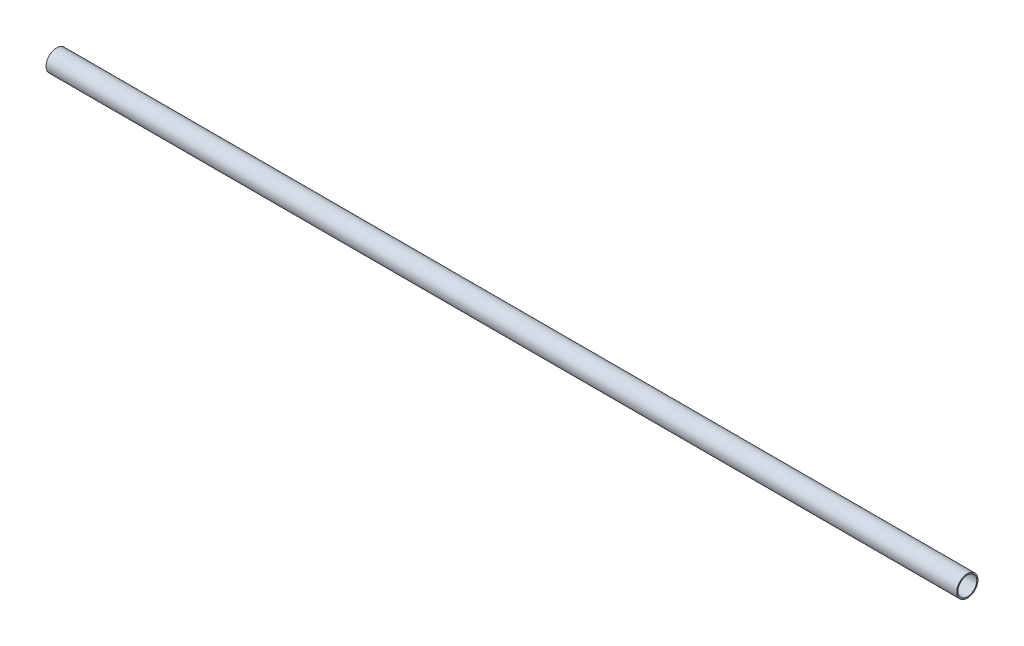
ISO-10303-21;
HEADER;
FILE_DESCRIPTION(('STEP AP214'),'2;1');
FILE_NAME('part.step','',(''),(''),'','','');
FILE_SCHEMA(('AUTOMOTIVE_DESIGN { 1 0 10303 214 1 1 1 1 }'));
ENDSEC;
DATA;
#1=APPLICATION_CONTEXT('core data for automotive mechanical design processes');
#2=APPLICATION_PROTOCOL_DEFINITION('international standard','automotive_design',2000,#1);
#3=PRODUCT_CONTEXT('',#1,'mechanical');
#4=PRODUCT('Part','Part','',(#3));
#5=PRODUCT_RELATED_PRODUCT_CATEGORY('part','',(#4));
#6=PRODUCT_DEFINITION_FORMATION('','',#4);
#7=PRODUCT_DEFINITION_CONTEXT('part definition',#1,'design');
#8=PRODUCT_DEFINITION('design','',#6,#7);
#9=PRODUCT_DEFINITION_SHAPE('','',#8);
#10=(LENGTH_UNIT() NAMED_UNIT(*) SI_UNIT(.MILLI.,.METRE.));
#11=(NAMED_UNIT(*) PLANE_ANGLE_UNIT() SI_UNIT($,.RADIAN.));
#12=(NAMED_UNIT(*) SI_UNIT($,.STERADIAN.) SOLID_ANGLE_UNIT());
#13=UNCERTAINTY_MEASURE_WITH_UNIT(LENGTH_MEASURE(1.E-05),#10,'distance_accuracy_value','');
#14=(GEOMETRIC_REPRESENTATION_CONTEXT(3) GLOBAL_UNCERTAINTY_ASSIGNED_CONTEXT((#13)) GLOBAL_UNIT_ASSIGNED_CONTEXT((#10,
#11,#12)) REPRESENTATION_CONTEXT('',''));
#15=CARTESIAN_POINT('',(0.,0.,0.));
#16=DIRECTION('',(0.,0.,1.));
#17=DIRECTION('',(1.,0.,0.));
#18=AXIS2_PLACEMENT_3D('',#15,#16,#17);
#19=CARTESIAN_POINT('',(1500.,0.,0.));
#20=DIRECTION('',(1.,0.,0.));
#21=DIRECTION('',(0.,0.,-1.));
#22=AXIS2_PLACEMENT_3D('',#19,#20,#21);
#23=PLANE('',#22);
#24=CARTESIAN_POINT('',(1500.,0.,0.));
#25=DIRECTION('',(1.,0.,0.));
#26=DIRECTION('',(0.,0.,-1.));
#27=AXIS2_PLACEMENT_3D('',#24,#25,#26);
#28=CIRCLE('',#27,17.5);
#29=CARTESIAN_POINT('',(1500.,0.,-17.5));
#30=VERTEX_POINT('',#29);
#31=EDGE_CURVE('E10',#30,#30,#28,.T.);
#32=ORIENTED_EDGE('',*,*,#31,.T.);
#33=EDGE_LOOP('',(#32));
#34=FACE_BOUND('',#33,.T.);
#35=CARTESIAN_POINT('',(1500.,0.,0.));
#36=DIRECTION('',(1.,0.,0.));
#37=DIRECTION('',(0.,0.,-1.));
#38=AXIS2_PLACEMENT_3D('',#35,#36,#37);
#39=CIRCLE('',#38,15.5);
#40=CARTESIAN_POINT('',(1500.,0.,-15.5));
#41=VERTEX_POINT('',#40);
#42=EDGE_CURVE('E42',#41,#41,#39,.T.);
#43=ORIENTED_EDGE('',*,*,#42,.F.);
#44=EDGE_LOOP('',(#43));
#45=FACE_BOUND('',#44,.T.);
#46=ADVANCED_FACE('F31',(#34,#45),#23,.T.);
#47=CARTESIAN_POINT('',(0.,0.,0.));
#48=DIRECTION('',(1.,0.,0.));
#49=DIRECTION('',(0.,0.,-1.));
#50=AXIS2_PLACEMENT_3D('',#47,#48,#49);
#51=PLANE('',#50);
#52=CARTESIAN_POINT('',(0.,0.,0.));
#53=DIRECTION('',(1.,0.,0.));
#54=DIRECTION('',(0.,0.,-1.));
#55=AXIS2_PLACEMENT_3D('',#52,#53,#54);
#56=CIRCLE('',#55,17.5);
#57=CARTESIAN_POINT('',(0.,0.,-17.5));
#58=VERTEX_POINT('',#57);
#59=EDGE_CURVE('E35',#58,#58,#56,.T.);
#60=ORIENTED_EDGE('',*,*,#59,.F.);
#61=EDGE_LOOP('',(#60));
#62=FACE_BOUND('',#61,.T.);
#63=CARTESIAN_POINT('',(0.,0.,0.));
#64=DIRECTION('',(1.,0.,0.));
#65=DIRECTION('',(0.,0.,-1.));
#66=AXIS2_PLACEMENT_3D('',#63,#64,#65);
#67=CIRCLE('',#66,15.5);
#68=CARTESIAN_POINT('',(0.,0.,-15.5));
#69=VERTEX_POINT('',#68);
#70=EDGE_CURVE('E44',#69,#69,#67,.T.);
#71=ORIENTED_EDGE('',*,*,#70,.T.);
#72=EDGE_LOOP('',(#71));
#73=FACE_BOUND('',#72,.T.);
#74=ADVANCED_FACE('F54',(#62,#73),#51,.F.);
#75=CARTESIAN_POINT('',(1500.,0.,0.));
#76=DIRECTION('',(-1.,0.,0.));
#77=DIRECTION('',(0.,0.,1.));
#78=AXIS2_PLACEMENT_3D('',#75,#76,#77);
#79=CYLINDRICAL_SURFACE('',#78,17.5);
#80=ORIENTED_EDGE('',*,*,#31,.F.);
#81=EDGE_LOOP('',(#80));
#82=FACE_BOUND('',#81,.T.);
#83=ORIENTED_EDGE('',*,*,#59,.T.);
#84=EDGE_LOOP('',(#83));
#85=FACE_BOUND('',#84,.T.);
#86=ADVANCED_FACE('F33',(#82,#85),#79,.T.);
#87=CARTESIAN_POINT('',(1500.,0.,0.));
#88=DIRECTION('',(-1.,0.,0.));
#89=DIRECTION('',(0.,0.,1.));
#90=AXIS2_PLACEMENT_3D('',#87,#88,#89);
#91=CYLINDRICAL_SURFACE('',#90,15.5);
#92=ORIENTED_EDGE('',*,*,#42,.T.);
#93=EDGE_LOOP('',(#92));
#94=FACE_BOUND('',#93,.T.);
#95=ORIENTED_EDGE('',*,*,#70,.F.);
#96=EDGE_LOOP('',(#95));
#97=FACE_BOUND('',#96,.T.);
#98=ADVANCED_FACE('F50',(#94,#97),#91,.F.);
#99=CLOSED_SHELL('',(#46,#74,#86,#98));
#100=MANIFOLD_SOLID_BREP('B2',#99);
#101=ADVANCED_BREP_SHAPE_REPRESENTATION('',(#18,#100),#14);
#102=SHAPE_DEFINITION_REPRESENTATION(#9,#101);
ENDSEC;
END-ISO-10303-21;
